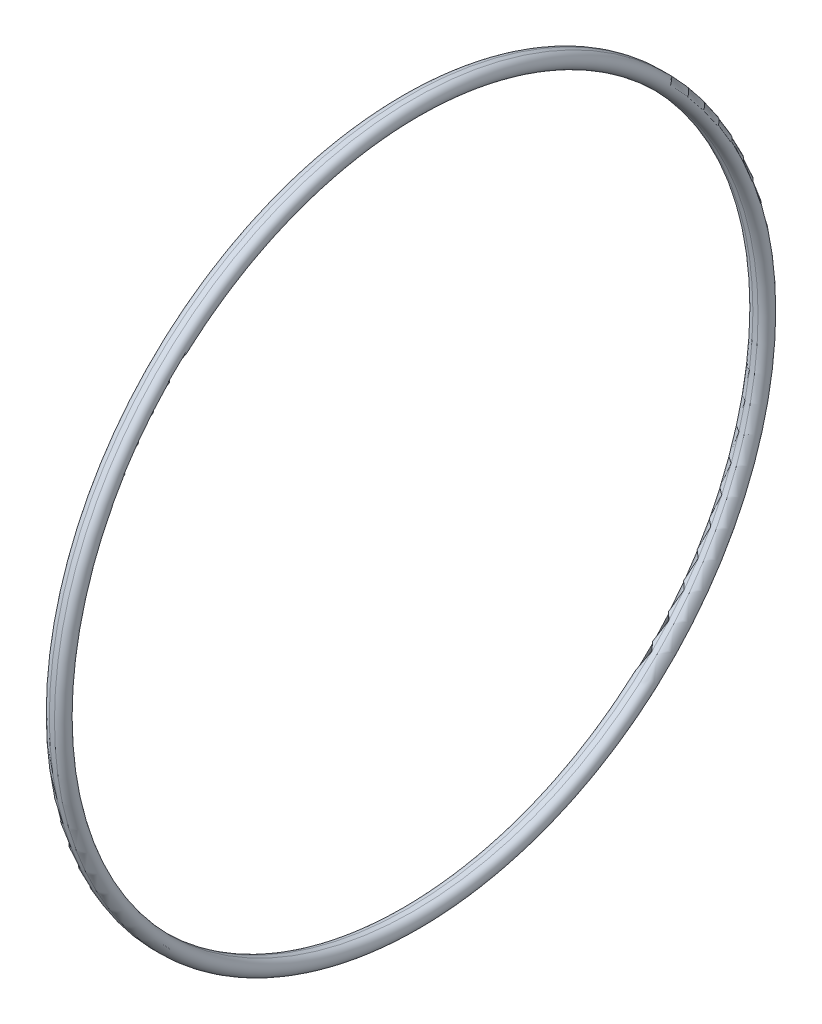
ISO-10303-21;
HEADER;
FILE_DESCRIPTION(('STEP AP214'),'2;1');
FILE_NAME('part.step','',(''),(''),'','','');
FILE_SCHEMA(('AUTOMOTIVE_DESIGN { 1 0 10303 214 1 1 1 1 }'));
ENDSEC;
DATA;
#1=APPLICATION_CONTEXT('core data for automotive mechanical design processes');
#2=APPLICATION_PROTOCOL_DEFINITION('international standard','automotive_design',2000,#1);
#3=PRODUCT_CONTEXT('',#1,'mechanical');
#4=PRODUCT('Part','Part','',(#3));
#5=PRODUCT_RELATED_PRODUCT_CATEGORY('part','',(#4));
#6=PRODUCT_DEFINITION_FORMATION('','',#4);
#7=PRODUCT_DEFINITION_CONTEXT('part definition',#1,'design');
#8=PRODUCT_DEFINITION('design','',#6,#7);
#9=PRODUCT_DEFINITION_SHAPE('','',#8);
#10=(LENGTH_UNIT() NAMED_UNIT(*) SI_UNIT(.MILLI.,.METRE.));
#11=(NAMED_UNIT(*) PLANE_ANGLE_UNIT() SI_UNIT($,.RADIAN.));
#12=(NAMED_UNIT(*) SI_UNIT($,.STERADIAN.) SOLID_ANGLE_UNIT());
#13=UNCERTAINTY_MEASURE_WITH_UNIT(LENGTH_MEASURE(1.E-05),#10,'distance_accuracy_value','');
#14=(GEOMETRIC_REPRESENTATION_CONTEXT(3) GLOBAL_UNCERTAINTY_ASSIGNED_CONTEXT((#13)) GLOBAL_UNIT_ASSIGNED_CONTEXT((#10,
#11,#12)) REPRESENTATION_CONTEXT('',''));
#15=CARTESIAN_POINT('',(0.,0.,0.));
#16=DIRECTION('',(0.,0.,1.));
#17=DIRECTION('',(1.,0.,0.));
#18=AXIS2_PLACEMENT_3D('',#15,#16,#17);
#19=CARTESIAN_POINT('',(-0.18,0.,0.));
#20=DIRECTION('',(-1.,0.,0.));
#21=DIRECTION('',(0.,0.,1.));
#22=AXIS2_PLACEMENT_3D('',#19,#20,#21);
#23=TOROIDAL_SURFACE('',#22,24.51,0.51);
#24=CARTESIAN_POINT('',(-0.18,0.,0.));
#25=DIRECTION('',(-1.,0.,0.));
#26=DIRECTION('',(0.,0.,1.));
#27=AXIS2_PLACEMENT_3D('',#24,#25,#26);
#28=CIRCLE('',#27,25.02);
#29=CARTESIAN_POINT('',(-0.18,0.,25.02));
#30=VERTEX_POINT('',#29);
#31=EDGE_CURVE('E10',#30,#30,#28,.T.);
#32=ORIENTED_EDGE('',*,*,#31,.T.);
#33=EDGE_LOOP('',(#32));
#34=FACE_BOUND('',#33,.T.);
#35=CARTESIAN_POINT('',(-0.18,0.,0.));
#36=DIRECTION('',(-1.,0.,0.));
#37=DIRECTION('',(0.,0.,1.));
#38=AXIS2_PLACEMENT_3D('',#35,#36,#37);
#39=CIRCLE('',#38,24.);
#40=CARTESIAN_POINT('',(-0.18,0.,24.));
#41=VERTEX_POINT('',#40);
#42=EDGE_CURVE('E29',#41,#41,#39,.T.);
#43=ORIENTED_EDGE('',*,*,#42,.F.);
#44=EDGE_LOOP('',(#43));
#45=FACE_BOUND('',#44,.T.);
#46=ADVANCED_FACE('F15',(#34,#45),#23,.T.);
#47=CARTESIAN_POINT('',(0.,0.,0.));
#48=DIRECTION('',(-1.,0.,0.));
#49=DIRECTION('',(0.,0.,1.));
#50=AXIS2_PLACEMENT_3D('',#47,#48,#49);
#51=CYLINDRICAL_SURFACE('',#50,25.02);
#52=CARTESIAN_POINT('',(0.18,0.,0.));
#53=DIRECTION('',(-1.,0.,0.));
#54=DIRECTION('',(0.,0.,1.));
#55=AXIS2_PLACEMENT_3D('',#52,#53,#54);
#56=CIRCLE('',#55,25.02);
#57=CARTESIAN_POINT('',(0.18,0.,25.02));
#58=VERTEX_POINT('',#57);
#59=EDGE_CURVE('E21',#58,#58,#56,.T.);
#60=ORIENTED_EDGE('',*,*,#59,.T.);
#61=EDGE_LOOP('',(#60));
#62=FACE_BOUND('',#61,.T.);
#63=ORIENTED_EDGE('',*,*,#31,.F.);
#64=EDGE_LOOP('',(#63));
#65=FACE_BOUND('',#64,.T.);
#66=ADVANCED_FACE('F39',(#62,#65),#51,.T.);
#67=CARTESIAN_POINT('',(0.18,0.,0.));
#68=DIRECTION('',(-1.,0.,0.));
#69=DIRECTION('',(0.,0.,1.));
#70=AXIS2_PLACEMENT_3D('',#67,#68,#69);
#71=TOROIDAL_SURFACE('',#70,24.51,0.51);
#72=CARTESIAN_POINT('',(0.18,0.,0.));
#73=DIRECTION('',(-1.,0.,0.));
#74=DIRECTION('',(0.,0.,1.));
#75=AXIS2_PLACEMENT_3D('',#72,#73,#74);
#76=CIRCLE('',#75,24.);
#77=CARTESIAN_POINT('',(0.18,0.,24.));
#78=VERTEX_POINT('',#77);
#79=EDGE_CURVE('E25',#78,#78,#76,.T.);
#80=ORIENTED_EDGE('',*,*,#79,.T.);
#81=EDGE_LOOP('',(#80));
#82=FACE_BOUND('',#81,.T.);
#83=ORIENTED_EDGE('',*,*,#59,.F.);
#84=EDGE_LOOP('',(#83));
#85=FACE_BOUND('',#84,.T.);
#86=ADVANCED_FACE('F44',(#82,#85),#71,.T.);
#87=CARTESIAN_POINT('',(0.,0.,0.));
#88=DIRECTION('',(-1.,0.,0.));
#89=DIRECTION('',(0.,0.,1.));
#90=AXIS2_PLACEMENT_3D('',#87,#88,#89);
#91=CYLINDRICAL_SURFACE('',#90,24.);
#92=ORIENTED_EDGE('',*,*,#42,.T.);
#93=EDGE_LOOP('',(#92));
#94=FACE_BOUND('',#93,.T.);
#95=ORIENTED_EDGE('',*,*,#79,.F.);
#96=EDGE_LOOP('',(#95));
#97=FACE_BOUND('',#96,.T.);
#98=ADVANCED_FACE('F35',(#94,#97),#91,.F.);
#99=CLOSED_SHELL('',(#46,#66,#86,#98));
#100=MANIFOLD_SOLID_BREP('B1',#99);
#101=ADVANCED_BREP_SHAPE_REPRESENTATION('',(#18,#100),#14);
#102=SHAPE_DEFINITION_REPRESENTATION(#9,#101);
ENDSEC;
END-ISO-10303-21;
